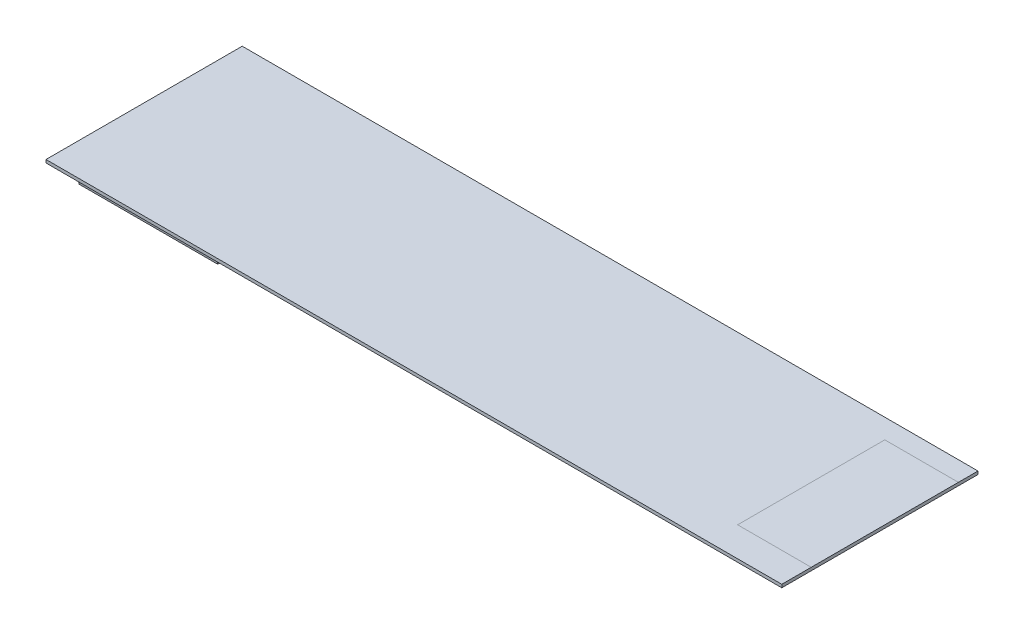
from build123d import *

# Parameters (mm, degrees)
SKETCH1_W           = 3048
SKETCH1_H           = 812.8
BOSS_EXTRUDE1_DEPTH = 12.7
SKETCH4_W           = 609.6
SKETCH4_H           = 609.6
BOSS_EXTRUDE2_DEPTH = 127
BOSS_EXTRUDE2_TAPER = 8
SKETCH3_W           = 508
SKETCH3_H           = 406.4
CUT_EXTRUDE1_DEPTH  = 38.1


with BuildPart() as part:
    # Sketch1 → Boss-Extrude1 (new body)
    with BuildSketch(Plane(origin=(0, 0, 0), x_dir=(1, 0, 0), z_dir=(0, 1, 0))):
        with Locations((1524, 406.4)):
            Rectangle(SKETCH1_W, SKETCH1_H)
    extrude(amount=BOSS_EXTRUDE1_DEPTH)

    # Sketch4 → Boss-Extrude2 (add)
    with BuildSketch(Plane.XZ):
        with Locations((304.8, -406.4)):
            Rectangle(SKETCH4_W, SKETCH4_H)
    extrude(amount=BOSS_EXTRUDE2_DEPTH, taper=BOSS_EXTRUDE2_TAPER)

    # Sketch3 → Cut-Extrude1 (cut)
    with BuildSketch(Plane.XZ.offset(127)):
        with Locations((254, -381)):
            Rectangle(SKETCH3_W, SKETCH3_H)
    extrude(amount=-CUT_EXTRUDE1_DEPTH, mode=Mode.SUBTRACT)


solid = part.part
